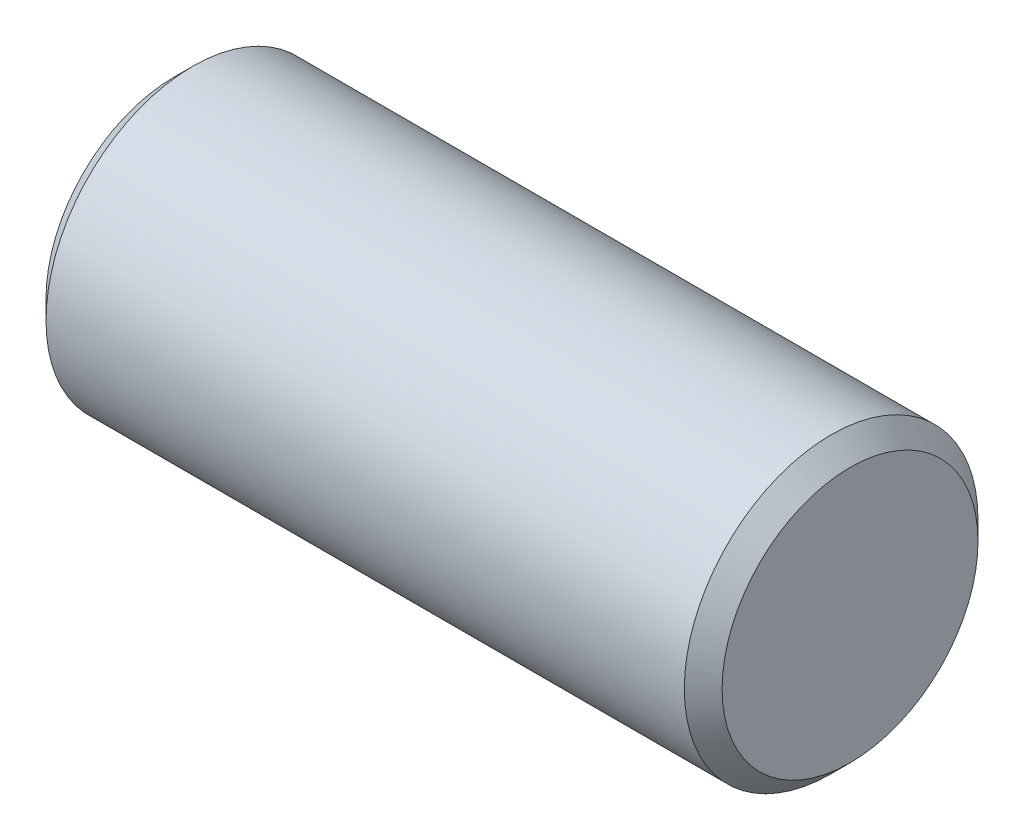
from build123d import *


with BuildPart() as part:
    # Sketch1 → Revolve1 (revolve)
    with BuildSketch(Plane.XY, mode=Mode.PRIVATE) as revolve1_sk:
        Polygon((0, 0), (0, 1.72085), (0.254, 1.97485), (8.8392, 1.97485), (9.0932, 1.72085), (9.0932, 0), align=None)
    revolve(revolve1_sk.sketch.rotate(Axis((0, 0, 0), (1, 0, 0)), 90), axis=Axis((0, 0, 0), (1, 0, 0)))


solid = part.part
